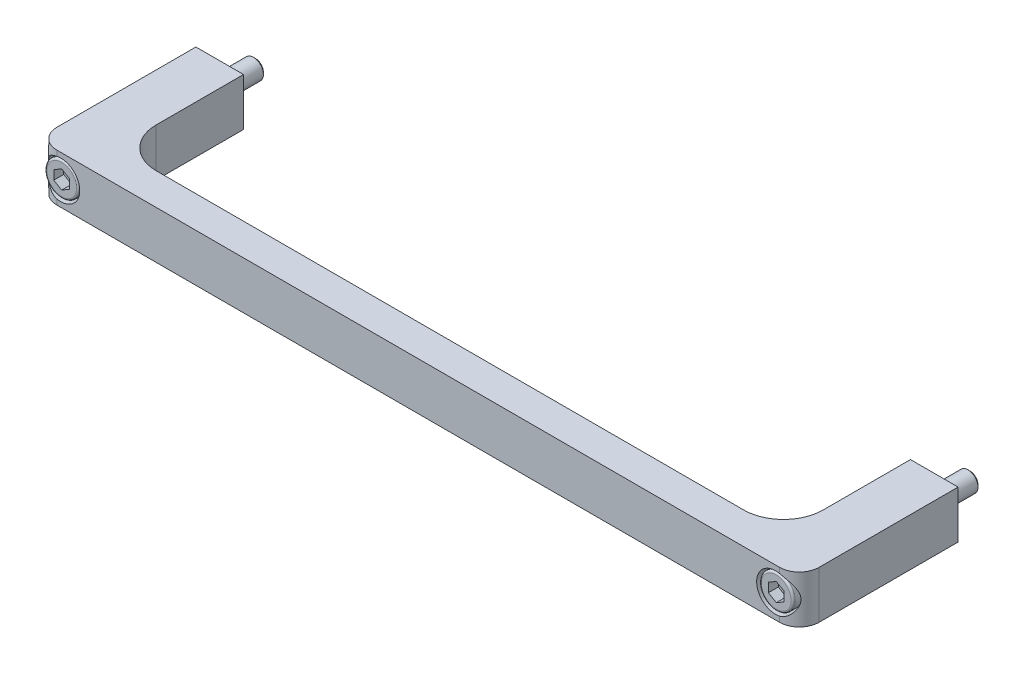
ISO-10303-21;
HEADER;
FILE_DESCRIPTION(('STEP AP214'),'2;1');
FILE_NAME('part.step','',(''),(''),'','','');
FILE_SCHEMA(('AUTOMOTIVE_DESIGN { 1 0 10303 214 1 1 1 1 }'));
ENDSEC;
DATA;
#1=APPLICATION_CONTEXT('core data for automotive mechanical design processes');
#2=APPLICATION_PROTOCOL_DEFINITION('international standard','automotive_design',2000,#1);
#3=PRODUCT_CONTEXT('',#1,'mechanical');
#4=PRODUCT('Part','Part','',(#3));
#5=PRODUCT_RELATED_PRODUCT_CATEGORY('part','',(#4));
#6=PRODUCT_DEFINITION_FORMATION('','',#4);
#7=PRODUCT_DEFINITION_CONTEXT('part definition',#1,'design');
#8=PRODUCT_DEFINITION('design','',#6,#7);
#9=PRODUCT_DEFINITION_SHAPE('','',#8);
#10=(LENGTH_UNIT() NAMED_UNIT(*) SI_UNIT(.MILLI.,.METRE.));
#11=(NAMED_UNIT(*) PLANE_ANGLE_UNIT() SI_UNIT($,.RADIAN.));
#12=(NAMED_UNIT(*) SI_UNIT($,.STERADIAN.) SOLID_ANGLE_UNIT());
#13=UNCERTAINTY_MEASURE_WITH_UNIT(LENGTH_MEASURE(1.E-05),#10,'distance_accuracy_value','');
#14=(GEOMETRIC_REPRESENTATION_CONTEXT(3) GLOBAL_UNCERTAINTY_ASSIGNED_CONTEXT((#13)) GLOBAL_UNIT_ASSIGNED_CONTEXT((#10,
#11,#12)) REPRESENTATION_CONTEXT('',''));
#15=CARTESIAN_POINT('',(0.,0.,0.));
#16=DIRECTION('',(0.,0.,1.));
#17=DIRECTION('',(1.,0.,0.));
#18=AXIS2_PLACEMENT_3D('',#15,#16,#17);
#19=CARTESIAN_POINT('',(180.,-1.38960957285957E-13,39.8));
#20=DIRECTION('',(0.,0.,-1.));
#21=DIRECTION('',(0.,1.,0.));
#22=AXIS2_PLACEMENT_3D('',#19,#20,#21);
#23=PLANE('',#22);
#24=CARTESIAN_POINT('',(180.,-1.38960957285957E-13,39.8));
#25=DIRECTION('',(0.,0.,-1.));
#26=DIRECTION('',(0.,1.,0.));
#27=AXIS2_PLACEMENT_3D('',#24,#25,#26);
#28=CIRCLE('',#27,3.75);
#29=CARTESIAN_POINT('',(180.,3.74999999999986,39.8));
#30=VERTEX_POINT('',#29);
#31=EDGE_CURVE('E268',#30,#30,#28,.T.);
#32=ORIENTED_EDGE('',*,*,#31,.F.);
#33=EDGE_LOOP('',(#32));
#34=FACE_BOUND('',#33,.T.);
#35=DIRECTION('',(0.,-1.,0.));
#36=VECTOR('',#35,1.);
#37=CARTESIAN_POINT('',(178.,-1.38960957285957E-13,39.8));
#38=LINE('',#37,#36);
#39=CARTESIAN_POINT('',(178.,1.15470053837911,39.8));
#40=VERTEX_POINT('',#39);
#41=CARTESIAN_POINT('',(178.,-1.15470053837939,39.8));
#42=VERTEX_POINT('',#41);
#43=EDGE_CURVE('E9',#40,#42,#38,.T.);
#44=ORIENTED_EDGE('',*,*,#43,.F.);
#45=DIRECTION('',(-0.866025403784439,-0.5,0.));
#46=VECTOR('',#45,1.);
#47=CARTESIAN_POINT('',(179.,1.73205080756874,39.8));
#48=LINE('',#47,#46);
#49=CARTESIAN_POINT('',(180.,2.30940107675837,39.8));
#50=VERTEX_POINT('',#49);
#51=EDGE_CURVE('E433',#50,#40,#48,.T.);
#52=ORIENTED_EDGE('',*,*,#51,.F.);
#53=DIRECTION('',(-0.866025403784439,0.5,0.));
#54=VECTOR('',#53,1.);
#55=CARTESIAN_POINT('',(181.,1.73205080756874,39.8));
#56=LINE('',#55,#54);
#57=CARTESIAN_POINT('',(182.,1.15470053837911,39.8));
#58=VERTEX_POINT('',#57);
#59=EDGE_CURVE('E435',#58,#50,#56,.T.);
#60=ORIENTED_EDGE('',*,*,#59,.F.);
#61=DIRECTION('',(0.,1.,0.));
#62=VECTOR('',#61,1.);
#63=CARTESIAN_POINT('',(182.,-1.38960957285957E-13,39.8));
#64=LINE('',#63,#62);
#65=CARTESIAN_POINT('',(182.,-1.15470053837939,39.8));
#66=VERTEX_POINT('',#65);
#67=EDGE_CURVE('E437',#66,#58,#64,.T.);
#68=ORIENTED_EDGE('',*,*,#67,.F.);
#69=DIRECTION('',(0.866025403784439,0.5,0.));
#70=VECTOR('',#69,1.);
#71=CARTESIAN_POINT('',(181.,-1.73205080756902,39.8));
#72=LINE('',#71,#70);
#73=CARTESIAN_POINT('',(180.,-2.30940107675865,39.8));
#74=VERTEX_POINT('',#73);
#75=EDGE_CURVE('E439',#74,#66,#72,.T.);
#76=ORIENTED_EDGE('',*,*,#75,.F.);
#77=DIRECTION('',(0.866025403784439,-0.5,0.));
#78=VECTOR('',#77,1.);
#79=CARTESIAN_POINT('',(179.,-1.73205080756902,39.8));
#80=LINE('',#79,#78);
#81=EDGE_CURVE('E23',#42,#74,#80,.T.);
#82=ORIENTED_EDGE('',*,*,#81,.F.);
#83=EDGE_LOOP('',(#44,#52,#60,#68,#76,#82));
#84=FACE_BOUND('',#83,.T.);
#85=ADVANCED_FACE('F14',(#34,#84),#23,.F.);
#86=CARTESIAN_POINT('',(0.,-1.38960957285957E-13,39.8));
#87=DIRECTION('',(0.,0.,-1.));
#88=DIRECTION('',(0.,1.,0.));
#89=AXIS2_PLACEMENT_3D('',#86,#87,#88);
#90=PLANE('',#89);
#91=CARTESIAN_POINT('',(0.,-1.38960957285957E-13,39.8));
#92=DIRECTION('',(0.,0.,-1.));
#93=DIRECTION('',(0.,1.,0.));
#94=AXIS2_PLACEMENT_3D('',#91,#92,#93);
#95=CIRCLE('',#94,3.75);
#96=CARTESIAN_POINT('',(0.,3.74999999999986,39.8));
#97=VERTEX_POINT('',#96);
#98=EDGE_CURVE('E277',#97,#97,#95,.T.);
#99=ORIENTED_EDGE('',*,*,#98,.F.);
#100=EDGE_LOOP('',(#99));
#101=FACE_BOUND('',#100,.T.);
#102=DIRECTION('',(0.,-1.,0.));
#103=VECTOR('',#102,1.);
#104=CARTESIAN_POINT('',(-2.,-1.38960957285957E-13,39.8));
#105=LINE('',#104,#103);
#106=CARTESIAN_POINT('',(-2.,1.15470053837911,39.8));
#107=VERTEX_POINT('',#106);
#108=CARTESIAN_POINT('',(-2.,-1.15470053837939,39.8));
#109=VERTEX_POINT('',#108);
#110=EDGE_CURVE('E431',#107,#109,#105,.T.);
#111=ORIENTED_EDGE('',*,*,#110,.F.);
#112=DIRECTION('',(-0.866025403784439,-0.5,0.));
#113=VECTOR('',#112,1.);
#114=CARTESIAN_POINT('',(-1.,1.73205080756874,39.8));
#115=LINE('',#114,#113);
#116=CARTESIAN_POINT('',(0.,2.30940107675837,39.8));
#117=VERTEX_POINT('',#116);
#118=EDGE_CURVE('E420',#117,#107,#115,.T.);
#119=ORIENTED_EDGE('',*,*,#118,.F.);
#120=DIRECTION('',(-0.866025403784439,0.5,0.));
#121=VECTOR('',#120,1.);
#122=CARTESIAN_POINT('',(1.,1.73205080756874,39.8));
#123=LINE('',#122,#121);
#124=CARTESIAN_POINT('',(2.,1.15470053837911,39.8));
#125=VERTEX_POINT('',#124);
#126=EDGE_CURVE('E422',#125,#117,#123,.T.);
#127=ORIENTED_EDGE('',*,*,#126,.F.);
#128=DIRECTION('',(0.,1.,0.));
#129=VECTOR('',#128,1.);
#130=CARTESIAN_POINT('',(2.,-1.38960957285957E-13,39.8));
#131=LINE('',#130,#129);
#132=CARTESIAN_POINT('',(2.,-1.15470053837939,39.8));
#133=VERTEX_POINT('',#132);
#134=EDGE_CURVE('E424',#133,#125,#131,.T.);
#135=ORIENTED_EDGE('',*,*,#134,.F.);
#136=DIRECTION('',(0.866025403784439,0.5,0.));
#137=VECTOR('',#136,1.);
#138=CARTESIAN_POINT('',(1.,-1.73205080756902,39.8));
#139=LINE('',#138,#137);
#140=CARTESIAN_POINT('',(0.,-2.30940107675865,39.8));
#141=VERTEX_POINT('',#140);
#142=EDGE_CURVE('E426',#141,#133,#139,.T.);
#143=ORIENTED_EDGE('',*,*,#142,.F.);
#144=DIRECTION('',(0.866025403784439,-0.5,0.));
#145=VECTOR('',#144,1.);
#146=CARTESIAN_POINT('',(-1.,-1.73205080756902,39.8));
#147=LINE('',#146,#145);
#148=EDGE_CURVE('E429',#109,#141,#147,.T.);
#149=ORIENTED_EDGE('',*,*,#148,.F.);
#150=EDGE_LOOP('',(#111,#119,#127,#135,#143,#149));
#151=FACE_BOUND('',#150,.T.);
#152=ADVANCED_FACE('F520',(#101,#151),#90,.F.);
#153=CARTESIAN_POINT('',(181.,-6.00000000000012,35.));
#154=DIRECTION('',(0.,1.,0.));
#155=DIRECTION('',(-1.,0.,0.));
#156=AXIS2_PLACEMENT_3D('',#153,#154,#155);
#157=CYLINDRICAL_SURFACE('',#156,5.);
#158=CARTESIAN_POINT('',(181.,-4.64354390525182,40.));
#159=CARTESIAN_POINT('',(181.113577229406,-4.61911352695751,40.000026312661));
#160=CARTESIAN_POINT('',(181.226198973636,-4.5904727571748,39.996131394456));
#161=CARTESIAN_POINT('',(181.448480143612,-4.5252330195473,39.9810830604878));
#162=CARTESIAN_POINT('',(181.558142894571,-4.48864344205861,39.9699381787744));
#163=CARTESIAN_POINT('',(181.772778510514,-4.40826406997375,39.9410985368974));
#164=CARTESIAN_POINT('',(181.877784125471,-4.36454038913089,39.9234622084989));
#165=CARTESIAN_POINT('',(182.083450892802,-4.27019279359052,39.8823298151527));
#166=CARTESIAN_POINT('',(182.184110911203,-4.21956709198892,39.8588322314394));
#167=CARTESIAN_POINT('',(182.477816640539,-4.05863601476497,39.7808868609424));
#168=CARTESIAN_POINT('',(182.663755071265,-3.93883272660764,39.7188155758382));
#169=CARTESIAN_POINT('',(183.014161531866,-3.67767986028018,39.5802666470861));
#170=CARTESIAN_POINT('',(183.178576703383,-3.53627901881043,39.5037546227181));
#171=CARTESIAN_POINT('',(183.505563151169,-3.2145083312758,39.3313669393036));
#172=CARTESIAN_POINT('',(183.664844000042,-3.03145406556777,39.2342729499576));
#173=CARTESIAN_POINT('',(183.953554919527,-2.64393120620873,39.0381869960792));
#174=CARTESIAN_POINT('',(184.082967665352,-2.43945028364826,38.9391939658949));
#175=CARTESIAN_POINT('',(184.300406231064,-2.02927596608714,38.7583847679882));
#176=CARTESIAN_POINT('',(184.391102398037,-1.82533494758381,38.6758243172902));
#177=CARTESIAN_POINT('',(184.544220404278,-1.40111936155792,38.528431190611));
#178=CARTESIAN_POINT('',(184.606705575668,-1.18088268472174,38.4635589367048));
#179=CARTESIAN_POINT('',(184.68939020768,-0.777505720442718,38.3750946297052));
#180=CARTESIAN_POINT('',(184.715905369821,-0.597016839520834,38.3455288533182));
#181=CARTESIAN_POINT('',(184.74785251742,-0.232010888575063,38.3097185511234));
#182=CARTESIAN_POINT('',(184.753317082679,-0.0475004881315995,38.3034379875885));
#183=CARTESIAN_POINT('',(184.742772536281,0.32004763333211,38.3153716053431));
#184=CARTESIAN_POINT('',(184.726764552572,0.503085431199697,38.3335844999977));
#185=CARTESIAN_POINT('',(184.674507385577,0.862962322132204,38.3910845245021));
#186=CARTESIAN_POINT('',(184.638217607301,1.03978822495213,38.4304139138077));
#187=CARTESIAN_POINT('',(184.528000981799,1.45744491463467,38.544254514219));
#188=CARTESIAN_POINT('',(184.444640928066,1.69363572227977,38.626612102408));
#189=CARTESIAN_POINT('',(184.295087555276,2.03224760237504,38.7612447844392));
#190=CARTESIAN_POINT('',(184.24105214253,2.14265838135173,38.8080496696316));
#191=CARTESIAN_POINT('',(184.12505065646,2.35826640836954,38.9038071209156));
#192=CARTESIAN_POINT('',(184.063085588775,2.46346431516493,38.9527594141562));
#193=CARTESIAN_POINT('',(183.860708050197,2.77873907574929,39.1043117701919));
#194=CARTESIAN_POINT('',(183.707477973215,2.98020199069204,39.2081022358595));
#195=CARTESIAN_POINT('',(183.368846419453,3.35822314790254,39.4076351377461));
#196=CARTESIAN_POINT('',(183.183479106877,3.53480748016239,39.5033859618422));
#197=CARTESIAN_POINT('',(182.809666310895,3.83632408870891,39.6648073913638));
#198=CARTESIAN_POINT('',(182.625331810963,3.96502834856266,39.732815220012));
#199=CARTESIAN_POINT('',(182.333406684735,4.13890556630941,39.8199942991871));
#200=CARTESIAN_POINT('',(182.233611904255,4.19363274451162,39.8465668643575));
#201=CARTESIAN_POINT('',(182.029283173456,4.29622741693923,39.8940340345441));
#202=CARTESIAN_POINT('',(181.924750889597,4.34409729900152,39.9149306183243));
#203=CARTESIAN_POINT('',(181.687151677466,4.44253129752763,39.9543331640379));
#204=CARTESIAN_POINT('',(181.553015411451,4.49121867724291,39.9712061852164));
#205=CARTESIAN_POINT('',(181.348187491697,4.55522115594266,39.9883353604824));
#206=CARTESIAN_POINT('',(181.279206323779,4.57507245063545,39.9926820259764));
#207=CARTESIAN_POINT('',(181.140272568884,4.6116637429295,39.9985159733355));
#208=CARTESIAN_POINT('',(181.070319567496,4.6284023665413,40.0000019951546));
#209=CARTESIAN_POINT('',(181.,4.64354390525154,40.));
#210=B_SPLINE_CURVE_WITH_KNOTS('',3,(#158,#159,#160,#161,#162,#163,#164,#165,#166,#167,#168,
#169,#170,#171,#172,#173,#174,#175,#176,#177,#178,#179,#180,#181,#182,#183,#184,#185,#186,#187,
#188,#189,#190,#191,#192,#193,#194,#195,#196,#197,#198,#199,#200,#201,#202,#203,#204,#205,#206,
#207,#208,#209),.UNSPECIFIED.,.F.,.F.,(4,2,2,2,2,2,2,2,2,2,2,2,2,2,2,2,2,2,2,2,2,2,2,2,2,4),(0.,
0.348307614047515,0.696205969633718,1.04104644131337,1.38597636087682,2.07210353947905,
2.75988535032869,3.54118531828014,4.32293734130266,5.03460033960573,5.74465765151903,
6.29670085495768,6.84788932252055,7.3990488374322,7.95131549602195,8.73767249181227,
9.13202620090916,9.52632994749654,10.3438248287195,11.1604559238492,11.8620649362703,
12.2123213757,12.5624555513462,12.9924670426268,13.208090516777,13.4238089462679),.UNSPECIFIED.);
#211=CARTESIAN_POINT('',(181.,-4.64354390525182,40.));
#212=VERTEX_POINT('',#211);
#213=CARTESIAN_POINT('',(181.,4.64354390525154,40.));
#214=VERTEX_POINT('',#213);
#215=EDGE_CURVE('E283',#212,#214,#210,.T.);
#216=ORIENTED_EDGE('',*,*,#215,.F.);
#217=DIRECTION('',(0.,1.,0.));
#218=VECTOR('',#217,1.);
#219=CARTESIAN_POINT('',(181.,-6.00000000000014,40.));
#220=LINE('',#219,#218);
#221=CARTESIAN_POINT('',(181.,-6.00000000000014,40.));
#222=VERTEX_POINT('',#221);
#223=EDGE_CURVE('E387',#222,#212,#220,.T.);
#224=ORIENTED_EDGE('',*,*,#223,.F.);
#225=CARTESIAN_POINT('',(181.,-6.00000000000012,35.));
#226=DIRECTION('',(0.,-1.,0.));
#227=DIRECTION('',(1.,0.,0.));
#228=AXIS2_PLACEMENT_3D('',#225,#226,#227);
#229=CIRCLE('',#228,5.);
#230=CARTESIAN_POINT('',(186.,-6.00000000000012,35.));
#231=VERTEX_POINT('',#230);
#232=EDGE_CURVE('E349',#231,#222,#229,.T.);
#233=ORIENTED_EDGE('',*,*,#232,.F.);
#234=DIRECTION('',(0.,1.,0.));
#235=VECTOR('',#234,1.);
#236=CARTESIAN_POINT('',(186.,-6.00000000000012,35.));
#237=LINE('',#236,#235);
#238=CARTESIAN_POINT('',(186.,5.99999999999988,35.));
#239=VERTEX_POINT('',#238);
#240=EDGE_CURVE('E390',#231,#239,#237,.T.);
#241=ORIENTED_EDGE('',*,*,#240,.T.);
#242=CARTESIAN_POINT('',(181.,5.99999999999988,35.));
#243=DIRECTION('',(0.,-1.,0.));
#244=DIRECTION('',(1.,0.,0.));
#245=AXIS2_PLACEMENT_3D('',#242,#243,#244);
#246=CIRCLE('',#245,5.);
#247=CARTESIAN_POINT('',(181.,5.99999999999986,40.));
#248=VERTEX_POINT('',#247);
#249=EDGE_CURVE('E378',#239,#248,#246,.T.);
#250=ORIENTED_EDGE('',*,*,#249,.T.);
#251=EDGE_CURVE('E386',#214,#248,#220,.T.);
#252=ORIENTED_EDGE('',*,*,#251,.F.);
#253=EDGE_LOOP('',(#216,#224,#233,#241,#250,#252));
#254=FACE_BOUND('',#253,.T.);
#255=ADVANCED_FACE('F293',(#254),#157,.T.);
#256=CARTESIAN_POINT('',(-1.,-6.00000000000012,35.));
#257=DIRECTION('',(0.,1.,0.));
#258=DIRECTION('',(-1.,0.,0.));
#259=AXIS2_PLACEMENT_3D('',#256,#257,#258);
#260=CYLINDRICAL_SURFACE('',#259,5.);
#261=CARTESIAN_POINT('',(-1.,4.64354390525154,40.));
#262=CARTESIAN_POINT('',(-1.11357722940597,4.61911352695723,40.000026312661));
#263=CARTESIAN_POINT('',(-1.22619897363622,4.59047275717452,39.9961313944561));
#264=CARTESIAN_POINT('',(-1.44848014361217,4.52523301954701,39.9810830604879));
#265=CARTESIAN_POINT('',(-1.55814289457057,4.48864344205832,39.9699381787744));
#266=CARTESIAN_POINT('',(-1.77277851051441,4.40826406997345,39.9410985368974));
#267=CARTESIAN_POINT('',(-1.87778412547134,4.36454038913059,39.9234622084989));
#268=CARTESIAN_POINT('',(-2.08345089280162,4.27019279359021,39.8823298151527));
#269=CARTESIAN_POINT('',(-2.18411091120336,4.21956709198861,39.8588322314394));
#270=CARTESIAN_POINT('',(-2.47781664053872,4.05863601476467,39.7808868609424));
#271=CARTESIAN_POINT('',(-2.66375507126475,3.93883272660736,39.7188155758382));
#272=CARTESIAN_POINT('',(-3.01416153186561,3.67767986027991,39.5802666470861));
#273=CARTESIAN_POINT('',(-3.17857670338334,3.53627901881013,39.5037546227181));
#274=CARTESIAN_POINT('',(-3.50556315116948,3.21450833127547,39.3313669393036));
#275=CARTESIAN_POINT('',(-3.66484400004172,3.03145406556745,39.2342729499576));
#276=CARTESIAN_POINT('',(-3.9535549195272,2.64393120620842,39.0381869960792));
#277=CARTESIAN_POINT('',(-4.08296766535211,2.43945028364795,38.9391939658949));
#278=CARTESIAN_POINT('',(-4.30040623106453,2.02927596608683,38.7583847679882));
#279=CARTESIAN_POINT('',(-4.39110239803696,1.82533494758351,38.6758243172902));
#280=CARTESIAN_POINT('',(-4.54422040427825,1.40111936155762,38.528431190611));
#281=CARTESIAN_POINT('',(-4.60670557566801,1.18088268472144,38.4635589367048));
#282=CARTESIAN_POINT('',(-4.68939020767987,0.777505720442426,38.3750946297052));
#283=CARTESIAN_POINT('',(-4.71590536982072,0.597016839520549,38.3455288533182));
#284=CARTESIAN_POINT('',(-4.74785251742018,0.23201088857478,38.3097185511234));
#285=CARTESIAN_POINT('',(-4.75331708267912,0.0475004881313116,38.3034379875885));
#286=CARTESIAN_POINT('',(-4.74277253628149,-0.320047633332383,38.3153716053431));
#287=CARTESIAN_POINT('',(-4.72676455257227,-0.503085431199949,38.3335844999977));
#288=CARTESIAN_POINT('',(-4.67450738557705,-0.862962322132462,38.3910845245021));
#289=CARTESIAN_POINT('',(-4.63821760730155,-1.03978822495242,38.4304139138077));
#290=CARTESIAN_POINT('',(-4.52800098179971,-1.45744491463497,38.5442545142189));
#291=CARTESIAN_POINT('',(-4.44464092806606,-1.69363572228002,38.626612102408));
#292=CARTESIAN_POINT('',(-4.29508755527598,-2.03224760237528,38.7612447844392));
#293=CARTESIAN_POINT('',(-4.24105214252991,-2.14265838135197,38.8080496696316));
#294=CARTESIAN_POINT('',(-4.1250506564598,-2.3582664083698,38.9038071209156));
#295=CARTESIAN_POINT('',(-4.06308558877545,-2.46346431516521,38.9527594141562));
#296=CARTESIAN_POINT('',(-3.86070805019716,-2.77873907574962,39.1043117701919));
#297=CARTESIAN_POINT('',(-3.7074779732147,-2.9802019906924,39.2081022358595));
#298=CARTESIAN_POINT('',(-3.36884641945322,-3.35822314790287,39.4076351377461));
#299=CARTESIAN_POINT('',(-3.18347910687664,-3.53480748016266,39.5033859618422));
#300=CARTESIAN_POINT('',(-2.80966631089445,-3.83632408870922,39.6648073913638));
#301=CARTESIAN_POINT('',(-2.62533181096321,-3.96502834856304,39.7328152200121));
#302=CARTESIAN_POINT('',(-2.33340668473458,-4.13890556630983,39.8199942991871));
#303=CARTESIAN_POINT('',(-2.23361190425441,-4.19363274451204,39.8465668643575));
#304=CARTESIAN_POINT('',(-2.02928317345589,-4.29622741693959,39.8940340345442));
#305=CARTESIAN_POINT('',(-1.92475088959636,-4.34409729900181,39.9149306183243));
#306=CARTESIAN_POINT('',(-1.68715167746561,-4.44253129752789,39.9543331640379));
#307=CARTESIAN_POINT('',(-1.55301541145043,-4.49121867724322,39.9712061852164));
#308=CARTESIAN_POINT('',(-1.34818749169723,-4.55522115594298,39.9883353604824));
#309=CARTESIAN_POINT('',(-1.27920632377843,-4.57507245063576,39.9926820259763));
#310=CARTESIAN_POINT('',(-1.14027256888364,-4.61166374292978,39.9985159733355));
#311=CARTESIAN_POINT('',(-1.07031956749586,-4.62840236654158,40.0000019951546));
#312=CARTESIAN_POINT('',(-1.,-4.64354390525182,40.));
#313=B_SPLINE_CURVE_WITH_KNOTS('',3,(#261,#262,#263,#264,#265,#266,#267,#268,#269,#270,#271,
#272,#273,#274,#275,#276,#277,#278,#279,#280,#281,#282,#283,#284,#285,#286,#287,#288,#289,#290,
#291,#292,#293,#294,#295,#296,#297,#298,#299,#300,#301,#302,#303,#304,#305,#306,#307,#308,#309,
#310,#311,#312),.UNSPECIFIED.,.F.,.F.,(4,2,2,2,2,2,2,2,2,2,2,2,2,2,2,2,2,2,2,2,2,2,2,2,2,4),(0.,
0.348307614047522,0.696205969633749,1.04104644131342,1.38597636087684,2.07210353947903,
2.75988535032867,3.5411853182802,4.32293734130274,5.03460033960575,5.74465765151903,
6.29670085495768,6.84788932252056,7.39904883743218,7.95131549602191,8.73767249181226,
9.13202620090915,9.52632994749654,10.3438248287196,11.1604559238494,11.8620649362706,
12.2123213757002,12.5624555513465,12.992467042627,13.2080905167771,13.4238089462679),.UNSPECIFIED.);
#314=CARTESIAN_POINT('',(-1.,4.64354390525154,40.));
#315=VERTEX_POINT('',#314);
#316=CARTESIAN_POINT('',(-1.,-4.64354390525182,40.));
#317=VERTEX_POINT('',#316);
#318=EDGE_CURVE('E317',#315,#317,#313,.T.);
#319=ORIENTED_EDGE('',*,*,#318,.F.);
#320=DIRECTION('',(0.,1.,0.));
#321=VECTOR('',#320,1.);
#322=CARTESIAN_POINT('',(-1.,-6.00000000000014,40.));
#323=LINE('',#322,#321);
#324=CARTESIAN_POINT('',(-1.,5.99999999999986,40.));
#325=VERTEX_POINT('',#324);
#326=EDGE_CURVE('E353',#315,#325,#323,.T.);
#327=ORIENTED_EDGE('',*,*,#326,.T.);
#328=CARTESIAN_POINT('',(-1.,5.99999999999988,35.));
#329=DIRECTION('',(0.,-1.,0.));
#330=DIRECTION('',(1.,0.,0.));
#331=AXIS2_PLACEMENT_3D('',#328,#329,#330);
#332=CIRCLE('',#331,5.);
#333=CARTESIAN_POINT('',(-6.,5.99999999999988,35.));
#334=VERTEX_POINT('',#333);
#335=EDGE_CURVE('E324',#325,#334,#332,.T.);
#336=ORIENTED_EDGE('',*,*,#335,.T.);
#337=DIRECTION('',(0.,1.,0.));
#338=VECTOR('',#337,1.);
#339=CARTESIAN_POINT('',(-6.,-6.00000000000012,35.));
#340=LINE('',#339,#338);
#341=CARTESIAN_POINT('',(-6.,-6.00000000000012,35.));
#342=VERTEX_POINT('',#341);
#343=EDGE_CURVE('E413',#342,#334,#340,.T.);
#344=ORIENTED_EDGE('',*,*,#343,.F.);
#345=CARTESIAN_POINT('',(-1.,-6.00000000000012,35.));
#346=DIRECTION('',(0.,-1.,0.));
#347=DIRECTION('',(1.,0.,0.));
#348=AXIS2_PLACEMENT_3D('',#345,#346,#347);
#349=CIRCLE('',#348,5.);
#350=CARTESIAN_POINT('',(-1.,-6.00000000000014,40.));
#351=VERTEX_POINT('',#350);
#352=EDGE_CURVE('E325',#351,#342,#349,.T.);
#353=ORIENTED_EDGE('',*,*,#352,.F.);
#354=EDGE_CURVE('E383',#351,#317,#323,.T.);
#355=ORIENTED_EDGE('',*,*,#354,.T.);
#356=EDGE_LOOP('',(#319,#327,#336,#344,#353,#355));
#357=FACE_BOUND('',#356,.T.);
#358=ADVANCED_FACE('F16',(#357),#260,.T.);
#359=CARTESIAN_POINT('',(-6.,-6.00000000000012,35.));
#360=DIRECTION('',(1.,0.,0.));
#361=DIRECTION('',(0.,1.,0.));
#362=AXIS2_PLACEMENT_3D('',#359,#360,#361);
#363=PLANE('',#362);
#364=DIRECTION('',(0.,0.,-1.));
#365=VECTOR('',#364,1.);
#366=CARTESIAN_POINT('',(-6.,5.99999999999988,35.));
#367=LINE('',#366,#365);
#368=CARTESIAN_POINT('',(-6.,6.,0.));
#369=VERTEX_POINT('',#368);
#370=EDGE_CURVE('E356',#334,#369,#367,.T.);
#371=ORIENTED_EDGE('',*,*,#370,.T.);
#372=DIRECTION('',(0.,1.,0.));
#373=VECTOR('',#372,1.);
#374=CARTESIAN_POINT('',(-6.,-6.,0.));
#375=LINE('',#374,#373);
#376=CARTESIAN_POINT('',(-6.,-6.,0.));
#377=VERTEX_POINT('',#376);
#378=EDGE_CURVE('E410',#377,#369,#375,.T.);
#379=ORIENTED_EDGE('',*,*,#378,.F.);
#380=DIRECTION('',(0.,0.,-1.));
#381=VECTOR('',#380,1.);
#382=CARTESIAN_POINT('',(-6.,-6.00000000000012,35.));
#383=LINE('',#382,#381);
#384=EDGE_CURVE('E328',#342,#377,#383,.T.);
#385=ORIENTED_EDGE('',*,*,#384,.F.);
#386=ORIENTED_EDGE('',*,*,#343,.T.);
#387=EDGE_LOOP('',(#371,#379,#385,#386));
#388=FACE_BOUND('',#387,.T.);
#389=ADVANCED_FACE('F565',(#388),#363,.F.);
#390=CARTESIAN_POINT('',(-6.,-6.,0.));
#391=DIRECTION('',(0.,0.,1.));
#392=DIRECTION('',(0.,-1.,0.));
#393=AXIS2_PLACEMENT_3D('',#390,#391,#392);
#394=PLANE('',#393);
#395=DIRECTION('',(1.,0.,0.));
#396=VECTOR('',#395,1.);
#397=CARTESIAN_POINT('',(-6.,6.,0.));
#398=LINE('',#397,#396);
#399=CARTESIAN_POINT('',(6.,6.,0.));
#400=VERTEX_POINT('',#399);
#401=EDGE_CURVE('E358',#369,#400,#398,.T.);
#402=ORIENTED_EDGE('',*,*,#401,.T.);
#403=DIRECTION('',(0.,1.,0.));
#404=VECTOR('',#403,1.);
#405=CARTESIAN_POINT('',(6.,-6.,0.));
#406=LINE('',#405,#404);
#407=CARTESIAN_POINT('',(6.,-6.,0.));
#408=VERTEX_POINT('',#407);
#409=EDGE_CURVE('E407',#408,#400,#406,.T.);
#410=ORIENTED_EDGE('',*,*,#409,.F.);
#411=DIRECTION('',(1.,0.,0.));
#412=VECTOR('',#411,1.);
#413=CARTESIAN_POINT('',(-6.,-6.,0.));
#414=LINE('',#413,#412);
#415=EDGE_CURVE('E331',#377,#408,#414,.T.);
#416=ORIENTED_EDGE('',*,*,#415,.F.);
#417=ORIENTED_EDGE('',*,*,#378,.T.);
#418=EDGE_LOOP('',(#402,#410,#416,#417));
#419=FACE_BOUND('',#418,.T.);
#420=CARTESIAN_POINT('',(0.,0.,0.));
#421=DIRECTION('',(0.,0.,-1.));
#422=DIRECTION('',(0.,1.,0.));
#423=AXIS2_PLACEMENT_3D('',#420,#421,#422);
#424=CIRCLE('',#423,2.5);
#425=CARTESIAN_POINT('',(0.,2.5,0.));
#426=VERTEX_POINT('',#425);
#427=EDGE_CURVE('E912',#426,#426,#424,.T.);
#428=ORIENTED_EDGE('',*,*,#427,.F.);
#429=EDGE_LOOP('',(#428));
#430=FACE_BOUND('',#429,.T.);
#431=ADVANCED_FACE('F600',(#419,#430),#394,.F.);
#432=CARTESIAN_POINT('',(6.,-6.,0.));
#433=DIRECTION('',(-1.,0.,0.));
#434=DIRECTION('',(0.,-1.,0.));
#435=AXIS2_PLACEMENT_3D('',#432,#433,#434);
#436=PLANE('',#435);
#437=DIRECTION('',(0.,0.,1.));
#438=VECTOR('',#437,1.);
#439=CARTESIAN_POINT('',(6.,6.,0.));
#440=LINE('',#439,#438);
#441=CARTESIAN_POINT('',(6.,5.99999999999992,22.));
#442=VERTEX_POINT('',#441);
#443=EDGE_CURVE('E360',#400,#442,#440,.T.);
#444=ORIENTED_EDGE('',*,*,#443,.T.);
#445=DIRECTION('',(0.,1.,0.));
#446=VECTOR('',#445,1.);
#447=CARTESIAN_POINT('',(6.,-6.00000000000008,22.));
#448=LINE('',#447,#446);
#449=CARTESIAN_POINT('',(6.,-6.00000000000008,22.));
#450=VERTEX_POINT('',#449);
#451=EDGE_CURVE('E405',#450,#442,#448,.T.);
#452=ORIENTED_EDGE('',*,*,#451,.F.);
#453=DIRECTION('',(0.,0.,1.));
#454=VECTOR('',#453,1.);
#455=CARTESIAN_POINT('',(6.,-6.,0.));
#456=LINE('',#455,#454);
#457=EDGE_CURVE('E333',#408,#450,#456,.T.);
#458=ORIENTED_EDGE('',*,*,#457,.F.);
#459=ORIENTED_EDGE('',*,*,#409,.T.);
#460=EDGE_LOOP('',(#444,#452,#458,#459));
#461=FACE_BOUND('',#460,.T.);
#462=ADVANCED_FACE('F605',(#461),#436,.F.);
#463=CARTESIAN_POINT('',(16.,-6.00000000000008,22.));
#464=DIRECTION('',(0.,1.,0.));
#465=DIRECTION('',(-1.,0.,0.));
#466=AXIS2_PLACEMENT_3D('',#463,#464,#465);
#467=CYLINDRICAL_SURFACE('',#466,10.);
#468=CARTESIAN_POINT('',(16.,5.99999999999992,22.));
#469=DIRECTION('',(0.,-1.,0.));
#470=DIRECTION('',(1.,0.,0.));
#471=AXIS2_PLACEMENT_3D('',#468,#469,#470);
#472=CIRCLE('',#471,10.);
#473=CARTESIAN_POINT('',(16.,5.99999999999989,32.));
#474=VERTEX_POINT('',#473);
#475=EDGE_CURVE('E363',#474,#442,#472,.T.);
#476=ORIENTED_EDGE('',*,*,#475,.F.);
#477=DIRECTION('',(0.,1.,0.));
#478=VECTOR('',#477,1.);
#479=CARTESIAN_POINT('',(16.,-6.00000000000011,32.));
#480=LINE('',#479,#478);
#481=CARTESIAN_POINT('',(16.,-6.00000000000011,32.));
#482=VERTEX_POINT('',#481);
#483=EDGE_CURVE('E403',#482,#474,#480,.T.);
#484=ORIENTED_EDGE('',*,*,#483,.F.);
#485=CARTESIAN_POINT('',(16.,-6.00000000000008,22.));
#486=DIRECTION('',(0.,-1.,0.));
#487=DIRECTION('',(1.,0.,0.));
#488=AXIS2_PLACEMENT_3D('',#485,#486,#487);
#489=CIRCLE('',#488,10.);
#490=EDGE_CURVE('E335',#482,#450,#489,.T.);
#491=ORIENTED_EDGE('',*,*,#490,.T.);
#492=ORIENTED_EDGE('',*,*,#451,.T.);
#493=EDGE_LOOP('',(#476,#484,#491,#492));
#494=FACE_BOUND('',#493,.T.);
#495=ADVANCED_FACE('F608',(#494),#467,.F.);
#496=CARTESIAN_POINT('',(16.,-6.00000000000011,32.));
#497=DIRECTION('',(0.,0.,1.));
#498=DIRECTION('',(0.,-1.,0.));
#499=AXIS2_PLACEMENT_3D('',#496,#497,#498);
#500=PLANE('',#499);
#501=DIRECTION('',(1.,0.,0.));
#502=VECTOR('',#501,1.);
#503=CARTESIAN_POINT('',(16.,5.99999999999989,32.));
#504=LINE('',#503,#502);
#505=CARTESIAN_POINT('',(164.,5.99999999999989,32.));
#506=VERTEX_POINT('',#505);
#507=EDGE_CURVE('E366',#474,#506,#504,.T.);
#508=ORIENTED_EDGE('',*,*,#507,.T.);
#509=DIRECTION('',(0.,1.,0.));
#510=VECTOR('',#509,1.);
#511=CARTESIAN_POINT('',(164.,-6.00000000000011,32.));
#512=LINE('',#511,#510);
#513=CARTESIAN_POINT('',(164.,-6.00000000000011,32.));
#514=VERTEX_POINT('',#513);
#515=EDGE_CURVE('E401',#514,#506,#512,.T.);
#516=ORIENTED_EDGE('',*,*,#515,.F.);
#517=DIRECTION('',(1.,0.,0.));
#518=VECTOR('',#517,1.);
#519=CARTESIAN_POINT('',(16.,-6.00000000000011,32.));
#520=LINE('',#519,#518);
#521=EDGE_CURVE('E338',#482,#514,#520,.T.);
#522=ORIENTED_EDGE('',*,*,#521,.F.);
#523=ORIENTED_EDGE('',*,*,#483,.T.);
#524=EDGE_LOOP('',(#508,#516,#522,#523));
#525=FACE_BOUND('',#524,.T.);
#526=ADVANCED_FACE('F613',(#525),#500,.F.);
#527=CARTESIAN_POINT('',(164.,-6.00000000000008,22.));
#528=DIRECTION('',(0.,1.,0.));
#529=DIRECTION('',(-1.,0.,0.));
#530=AXIS2_PLACEMENT_3D('',#527,#528,#529);
#531=CYLINDRICAL_SURFACE('',#530,10.);
#532=CARTESIAN_POINT('',(164.,5.99999999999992,22.));
#533=DIRECTION('',(0.,-1.,0.));
#534=DIRECTION('',(1.,0.,0.));
#535=AXIS2_PLACEMENT_3D('',#532,#533,#534);
#536=CIRCLE('',#535,10.);
#537=CARTESIAN_POINT('',(174.,5.99999999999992,22.));
#538=VERTEX_POINT('',#537);
#539=EDGE_CURVE('E369',#538,#506,#536,.T.);
#540=ORIENTED_EDGE('',*,*,#539,.F.);
#541=DIRECTION('',(0.,1.,0.));
#542=VECTOR('',#541,1.);
#543=CARTESIAN_POINT('',(174.,-6.00000000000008,22.));
#544=LINE('',#543,#542);
#545=CARTESIAN_POINT('',(174.,-6.00000000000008,22.));
#546=VERTEX_POINT('',#545);
#547=EDGE_CURVE('E399',#546,#538,#544,.T.);
#548=ORIENTED_EDGE('',*,*,#547,.F.);
#549=CARTESIAN_POINT('',(164.,-6.00000000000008,22.));
#550=DIRECTION('',(0.,-1.,0.));
#551=DIRECTION('',(1.,0.,0.));
#552=AXIS2_PLACEMENT_3D('',#549,#550,#551);
#553=CIRCLE('',#552,10.);
#554=EDGE_CURVE('E340',#546,#514,#553,.T.);
#555=ORIENTED_EDGE('',*,*,#554,.T.);
#556=ORIENTED_EDGE('',*,*,#515,.T.);
#557=EDGE_LOOP('',(#540,#548,#555,#556));
#558=FACE_BOUND('',#557,.T.);
#559=ADVANCED_FACE('F617',(#558),#531,.F.);
#560=CARTESIAN_POINT('',(174.,-6.00000000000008,22.));
#561=DIRECTION('',(1.,0.,0.));
#562=DIRECTION('',(0.,1.,0.));
#563=AXIS2_PLACEMENT_3D('',#560,#561,#562);
#564=PLANE('',#563);
#565=DIRECTION('',(0.,0.,-1.));
#566=VECTOR('',#565,1.);
#567=CARTESIAN_POINT('',(174.,5.99999999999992,22.));
#568=LINE('',#567,#566);
#569=CARTESIAN_POINT('',(174.,6.,0.));
#570=VERTEX_POINT('',#569);
#571=EDGE_CURVE('E372',#538,#570,#568,.T.);
#572=ORIENTED_EDGE('',*,*,#571,.T.);
#573=DIRECTION('',(0.,1.,0.));
#574=VECTOR('',#573,1.);
#575=CARTESIAN_POINT('',(174.,-6.,0.));
#576=LINE('',#575,#574);
#577=CARTESIAN_POINT('',(174.,-6.,0.));
#578=VERTEX_POINT('',#577);
#579=EDGE_CURVE('E396',#578,#570,#576,.T.);
#580=ORIENTED_EDGE('',*,*,#579,.F.);
#581=DIRECTION('',(0.,0.,-1.));
#582=VECTOR('',#581,1.);
#583=CARTESIAN_POINT('',(174.,-6.00000000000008,22.));
#584=LINE('',#583,#582);
#585=EDGE_CURVE('E343',#546,#578,#584,.T.);
#586=ORIENTED_EDGE('',*,*,#585,.F.);
#587=ORIENTED_EDGE('',*,*,#547,.T.);
#588=EDGE_LOOP('',(#572,#580,#586,#587));
#589=FACE_BOUND('',#588,.T.);
#590=ADVANCED_FACE('F622',(#589),#564,.F.);
#591=CARTESIAN_POINT('',(174.,-6.,0.));
#592=DIRECTION('',(0.,0.,1.));
#593=DIRECTION('',(0.,-1.,0.));
#594=AXIS2_PLACEMENT_3D('',#591,#592,#593);
#595=PLANE('',#594);
#596=DIRECTION('',(1.,0.,0.));
#597=VECTOR('',#596,1.);
#598=CARTESIAN_POINT('',(174.,6.,0.));
#599=LINE('',#598,#597);
#600=CARTESIAN_POINT('',(186.,6.,0.));
#601=VERTEX_POINT('',#600);
#602=EDGE_CURVE('E374',#570,#601,#599,.T.);
#603=ORIENTED_EDGE('',*,*,#602,.T.);
#604=DIRECTION('',(0.,1.,0.));
#605=VECTOR('',#604,1.);
#606=CARTESIAN_POINT('',(186.,-6.,0.));
#607=LINE('',#606,#605);
#608=CARTESIAN_POINT('',(186.,-6.,0.));
#609=VERTEX_POINT('',#608);
#610=EDGE_CURVE('E393',#609,#601,#607,.T.);
#611=ORIENTED_EDGE('',*,*,#610,.F.);
#612=DIRECTION('',(1.,0.,0.));
#613=VECTOR('',#612,1.);
#614=CARTESIAN_POINT('',(174.,-6.,0.));
#615=LINE('',#614,#613);
#616=EDGE_CURVE('E345',#578,#609,#615,.T.);
#617=ORIENTED_EDGE('',*,*,#616,.F.);
#618=ORIENTED_EDGE('',*,*,#579,.T.);
#619=EDGE_LOOP('',(#603,#611,#617,#618));
#620=FACE_BOUND('',#619,.T.);
#621=CARTESIAN_POINT('',(180.,0.,0.));
#622=DIRECTION('',(0.,0.,-1.));
#623=DIRECTION('',(0.,1.,0.));
#624=AXIS2_PLACEMENT_3D('',#621,#622,#623);
#625=CIRCLE('',#624,2.5);
#626=CARTESIAN_POINT('',(180.,2.5,0.));
#627=VERTEX_POINT('',#626);
#628=EDGE_CURVE('E916',#627,#627,#625,.T.);
#629=ORIENTED_EDGE('',*,*,#628,.F.);
#630=EDGE_LOOP('',(#629));
#631=FACE_BOUND('',#630,.T.);
#632=ADVANCED_FACE('F626',(#620,#631),#595,.F.);
#633=CARTESIAN_POINT('',(186.,-6.,0.));
#634=DIRECTION('',(-1.,0.,0.));
#635=DIRECTION('',(0.,-1.,0.));
#636=AXIS2_PLACEMENT_3D('',#633,#634,#635);
#637=PLANE('',#636);
#638=DIRECTION('',(0.,0.,1.));
#639=VECTOR('',#638,1.);
#640=CARTESIAN_POINT('',(186.,6.,0.));
#641=LINE('',#640,#639);
#642=EDGE_CURVE('E376',#601,#239,#641,.T.);
#643=ORIENTED_EDGE('',*,*,#642,.T.);
#644=ORIENTED_EDGE('',*,*,#240,.F.);
#645=DIRECTION('',(0.,0.,1.));
#646=VECTOR('',#645,1.);
#647=CARTESIAN_POINT('',(186.,-6.,0.));
#648=LINE('',#647,#646);
#649=EDGE_CURVE('E347',#609,#231,#648,.T.);
#650=ORIENTED_EDGE('',*,*,#649,.F.);
#651=ORIENTED_EDGE('',*,*,#610,.T.);
#652=EDGE_LOOP('',(#643,#644,#650,#651));
#653=FACE_BOUND('',#652,.T.);
#654=ADVANCED_FACE('F628',(#653),#637,.F.);
#655=CARTESIAN_POINT('',(181.,-6.00000000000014,40.));
#656=DIRECTION('',(0.,0.,-1.));
#657=DIRECTION('',(0.,1.,0.));
#658=AXIS2_PLACEMENT_3D('',#655,#656,#657);
#659=PLANE('',#658);
#660=CARTESIAN_POINT('',(180.,-1.39659253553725E-13,40.));
#661=DIRECTION('',(0.,0.,-1.));
#662=DIRECTION('',(0.,1.,0.));
#663=AXIS2_PLACEMENT_3D('',#660,#661,#662);
#664=CIRCLE('',#663,4.75);
#665=EDGE_CURVE('E418',#214,#212,#664,.F.);
#666=ORIENTED_EDGE('',*,*,#665,.F.);
#667=ORIENTED_EDGE('',*,*,#251,.T.);
#668=DIRECTION('',(-1.,0.,0.));
#669=VECTOR('',#668,1.);
#670=CARTESIAN_POINT('',(181.,5.99999999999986,40.));
#671=LINE('',#670,#669);
#672=EDGE_CURVE('E329',#248,#325,#671,.T.);
#673=ORIENTED_EDGE('',*,*,#672,.T.);
#674=ORIENTED_EDGE('',*,*,#326,.F.);
#675=CARTESIAN_POINT('',(0.,-1.39659253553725E-13,40.));
#676=DIRECTION('',(0.,0.,-1.));
#677=DIRECTION('',(0.,1.,0.));
#678=AXIS2_PLACEMENT_3D('',#675,#676,#677);
#679=CIRCLE('',#678,4.75);
#680=EDGE_CURVE('E416',#317,#315,#679,.F.);
#681=ORIENTED_EDGE('',*,*,#680,.F.);
#682=ORIENTED_EDGE('',*,*,#354,.F.);
#683=DIRECTION('',(-1.,0.,0.));
#684=VECTOR('',#683,1.);
#685=CARTESIAN_POINT('',(181.,-6.00000000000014,40.));
#686=LINE('',#685,#684);
#687=EDGE_CURVE('E351',#222,#351,#686,.T.);
#688=ORIENTED_EDGE('',*,*,#687,.F.);
#689=ORIENTED_EDGE('',*,*,#223,.T.);
#690=EDGE_LOOP('',(#666,#667,#673,#674,#681,#682,#688,#689));
#691=FACE_BOUND('',#690,.T.);
#692=ADVANCED_FACE('F575',(#691),#659,.F.);
#693=CARTESIAN_POINT('',(-1.,-6.00000000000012,35.));
#694=DIRECTION('',(0.,-1.,0.));
#695=DIRECTION('',(1.,0.,0.));
#696=AXIS2_PLACEMENT_3D('',#693,#694,#695);
#697=PLANE('',#696);
#698=ORIENTED_EDGE('',*,*,#352,.T.);
#699=ORIENTED_EDGE('',*,*,#384,.T.);
#700=ORIENTED_EDGE('',*,*,#415,.T.);
#701=ORIENTED_EDGE('',*,*,#457,.T.);
#702=ORIENTED_EDGE('',*,*,#490,.F.);
#703=ORIENTED_EDGE('',*,*,#521,.T.);
#704=ORIENTED_EDGE('',*,*,#554,.F.);
#705=ORIENTED_EDGE('',*,*,#585,.T.);
#706=ORIENTED_EDGE('',*,*,#616,.T.);
#707=ORIENTED_EDGE('',*,*,#649,.T.);
#708=ORIENTED_EDGE('',*,*,#232,.T.);
#709=ORIENTED_EDGE('',*,*,#687,.T.);
#710=EDGE_LOOP('',(#698,#699,#700,#701,#702,#703,#704,#705,#706,#707,#708,#709));
#711=FACE_BOUND('',#710,.T.);
#712=ADVANCED_FACE('F315',(#711),#697,.T.);
#713=CARTESIAN_POINT('',(-1.,5.99999999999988,35.));
#714=DIRECTION('',(0.,-1.,0.));
#715=DIRECTION('',(1.,0.,0.));
#716=AXIS2_PLACEMENT_3D('',#713,#714,#715);
#717=PLANE('',#716);
#718=ORIENTED_EDGE('',*,*,#335,.F.);
#719=ORIENTED_EDGE('',*,*,#672,.F.);
#720=ORIENTED_EDGE('',*,*,#249,.F.);
#721=ORIENTED_EDGE('',*,*,#642,.F.);
#722=ORIENTED_EDGE('',*,*,#602,.F.);
#723=ORIENTED_EDGE('',*,*,#571,.F.);
#724=ORIENTED_EDGE('',*,*,#539,.T.);
#725=ORIENTED_EDGE('',*,*,#507,.F.);
#726=ORIENTED_EDGE('',*,*,#475,.T.);
#727=ORIENTED_EDGE('',*,*,#443,.F.);
#728=ORIENTED_EDGE('',*,*,#401,.F.);
#729=ORIENTED_EDGE('',*,*,#370,.F.);
#730=EDGE_LOOP('',(#718,#719,#720,#721,#722,#723,#724,#725,#726,#727,#728,#729));
#731=FACE_BOUND('',#730,.T.);
#732=ADVANCED_FACE('F313',(#731),#717,.F.);
#733=CARTESIAN_POINT('',(0.,0.,0.));
#734=DIRECTION('',(0.,0.,-1.));
#735=DIRECTION('',(0.,1.,0.));
#736=AXIS2_PLACEMENT_3D('',#733,#734,#735);
#737=CYLINDRICAL_SURFACE('',#736,4.75);
#738=CARTESIAN_POINT('',(0.,-1.21503550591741E-13,34.8));
#739=DIRECTION('',(0.,0.,-1.));
#740=DIRECTION('',(0.,1.,0.));
#741=AXIS2_PLACEMENT_3D('',#738,#739,#740);
#742=CIRCLE('',#741,4.75);
#743=CARTESIAN_POINT('',(0.,4.74999999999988,34.8));
#744=VERTEX_POINT('',#743);
#745=EDGE_CURVE('E291',#744,#744,#742,.T.);
#746=ORIENTED_EDGE('',*,*,#745,.T.);
#747=EDGE_LOOP('',(#746));
#748=FACE_BOUND('',#747,.T.);
#749=ORIENTED_EDGE('',*,*,#318,.T.);
#750=ORIENTED_EDGE('',*,*,#680,.T.);
#751=EDGE_LOOP('',(#749,#750));
#752=FACE_BOUND('',#751,.T.);
#753=ADVANCED_FACE('F308',(#748,#752),#737,.F.);
#754=CARTESIAN_POINT('',(4.75,-1.21503550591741E-13,34.8));
#755=DIRECTION('',(0.,0.,1.));
#756=DIRECTION('',(0.,-1.,0.));
#757=AXIS2_PLACEMENT_3D('',#754,#755,#756);
#758=PLANE('',#757);
#759=CARTESIAN_POINT('',(0.,-1.21503550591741E-13,34.8));
#760=DIRECTION('',(0.,0.,-1.));
#761=DIRECTION('',(0.,1.,0.));
#762=AXIS2_PLACEMENT_3D('',#759,#760,#761);
#763=CIRCLE('',#762,4.25);
#764=CARTESIAN_POINT('',(0.,4.24999999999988,34.8));
#765=VERTEX_POINT('',#764);
#766=EDGE_CURVE('E271',#765,#765,#763,.T.);
#767=ORIENTED_EDGE('',*,*,#766,.T.);
#768=EDGE_LOOP('',(#767));
#769=FACE_BOUND('',#768,.T.);
#770=ORIENTED_EDGE('',*,*,#745,.F.);
#771=EDGE_LOOP('',(#770));
#772=FACE_BOUND('',#771,.T.);
#773=ADVANCED_FACE('F303',(#769,#772),#758,.T.);
#774=CARTESIAN_POINT('',(180.,0.,0.));
#775=DIRECTION('',(0.,0.,-1.));
#776=DIRECTION('',(0.,1.,0.));
#777=AXIS2_PLACEMENT_3D('',#774,#775,#776);
#778=CYLINDRICAL_SURFACE('',#777,4.75);
#779=CARTESIAN_POINT('',(180.,-1.21503550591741E-13,34.8));
#780=DIRECTION('',(0.,0.,-1.));
#781=DIRECTION('',(0.,1.,0.));
#782=AXIS2_PLACEMENT_3D('',#779,#780,#781);
#783=CIRCLE('',#782,4.75);
#784=CARTESIAN_POINT('',(180.,4.74999999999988,34.8));
#785=VERTEX_POINT('',#784);
#786=EDGE_CURVE('E280',#785,#785,#783,.T.);
#787=ORIENTED_EDGE('',*,*,#786,.T.);
#788=EDGE_LOOP('',(#787));
#789=FACE_BOUND('',#788,.T.);
#790=ORIENTED_EDGE('',*,*,#215,.T.);
#791=ORIENTED_EDGE('',*,*,#665,.T.);
#792=EDGE_LOOP('',(#790,#791));
#793=FACE_BOUND('',#792,.T.);
#794=ADVANCED_FACE('F297',(#789,#793),#778,.F.);
#795=CARTESIAN_POINT('',(184.75,-1.21503550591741E-13,34.8));
#796=DIRECTION('',(0.,0.,1.));
#797=DIRECTION('',(0.,-1.,0.));
#798=AXIS2_PLACEMENT_3D('',#795,#796,#797);
#799=PLANE('',#798);
#800=CARTESIAN_POINT('',(180.,-1.21503550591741E-13,34.8));
#801=DIRECTION('',(0.,0.,-1.));
#802=DIRECTION('',(0.,1.,0.));
#803=AXIS2_PLACEMENT_3D('',#800,#801,#802);
#804=CIRCLE('',#803,4.25);
#805=CARTESIAN_POINT('',(180.,4.24999999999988,34.8));
#806=VERTEX_POINT('',#805);
#807=EDGE_CURVE('E262',#806,#806,#804,.T.);
#808=ORIENTED_EDGE('',*,*,#807,.T.);
#809=EDGE_LOOP('',(#808));
#810=FACE_BOUND('',#809,.T.);
#811=ORIENTED_EDGE('',*,*,#786,.F.);
#812=EDGE_LOOP('',(#811));
#813=FACE_BOUND('',#812,.T.);
#814=ADVANCED_FACE('F302',(#810,#813),#799,.T.);
#815=CARTESIAN_POINT('',(0.,-1.37215216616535E-13,39.3));
#816=DIRECTION('',(0.,0.,-1.));
#817=DIRECTION('',(0.,1.,0.));
#818=AXIS2_PLACEMENT_3D('',#815,#816,#817);
#819=TOROIDAL_SURFACE('',#818,3.75,0.5);
#820=ORIENTED_EDGE('',*,*,#98,.T.);
#821=EDGE_LOOP('',(#820));
#822=FACE_BOUND('',#821,.T.);
#823=CARTESIAN_POINT('',(0.,-1.37215216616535E-13,39.3));
#824=DIRECTION('',(0.,0.,-1.));
#825=DIRECTION('',(0.,1.,0.));
#826=AXIS2_PLACEMENT_3D('',#823,#824,#825);
#827=CIRCLE('',#826,4.25);
#828=CARTESIAN_POINT('',(0.,4.24999999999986,39.3));
#829=VERTEX_POINT('',#828);
#830=EDGE_CURVE('E274',#829,#829,#827,.T.);
#831=ORIENTED_EDGE('',*,*,#830,.F.);
#832=EDGE_LOOP('',(#831));
#833=FACE_BOUND('',#832,.T.);
#834=ADVANCED_FACE('F530',(#822,#833),#819,.T.);
#835=CARTESIAN_POINT('',(0.,0.,-9.));
#836=DIRECTION('',(0.,0.,-1.));
#837=DIRECTION('',(0.,1.,0.));
#838=AXIS2_PLACEMENT_3D('',#835,#836,#837);
#839=CYLINDRICAL_SURFACE('',#838,4.25);
#840=ORIENTED_EDGE('',*,*,#766,.F.);
#841=EDGE_LOOP('',(#840));
#842=FACE_BOUND('',#841,.T.);
#843=ORIENTED_EDGE('',*,*,#830,.T.);
#844=EDGE_LOOP('',(#843));
#845=FACE_BOUND('',#844,.T.);
#846=ADVANCED_FACE('F516',(#842,#845),#839,.T.);
#847=CARTESIAN_POINT('',(180.,-1.37215216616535E-13,39.3));
#848=DIRECTION('',(0.,0.,-1.));
#849=DIRECTION('',(0.,1.,0.));
#850=AXIS2_PLACEMENT_3D('',#847,#848,#849);
#851=TOROIDAL_SURFACE('',#850,3.75000000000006,0.499999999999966);
#852=ORIENTED_EDGE('',*,*,#31,.T.);
#853=EDGE_LOOP('',(#852));
#854=FACE_BOUND('',#853,.T.);
#855=CARTESIAN_POINT('',(180.,-1.37215216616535E-13,39.3));
#856=DIRECTION('',(0.,0.,-1.));
#857=DIRECTION('',(0.,1.,0.));
#858=AXIS2_PLACEMENT_3D('',#855,#856,#857);
#859=CIRCLE('',#858,4.25);
#860=CARTESIAN_POINT('',(180.,4.24999999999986,39.3));
#861=VERTEX_POINT('',#860);
#862=EDGE_CURVE('E265',#861,#861,#859,.T.);
#863=ORIENTED_EDGE('',*,*,#862,.F.);
#864=EDGE_LOOP('',(#863));
#865=FACE_BOUND('',#864,.T.);
#866=ADVANCED_FACE('F512',(#854,#865),#851,.T.);
#867=CARTESIAN_POINT('',(180.,0.,-9.));
#868=DIRECTION('',(0.,0.,-1.));
#869=DIRECTION('',(0.,1.,0.));
#870=AXIS2_PLACEMENT_3D('',#867,#868,#869);
#871=CYLINDRICAL_SURFACE('',#870,4.25);
#872=ORIENTED_EDGE('',*,*,#807,.F.);
#873=EDGE_LOOP('',(#872));
#874=FACE_BOUND('',#873,.T.);
#875=ORIENTED_EDGE('',*,*,#862,.T.);
#876=EDGE_LOOP('',(#875));
#877=FACE_BOUND('',#876,.T.);
#878=ADVANCED_FACE('F503',(#874,#877),#871,.T.);
#879=CARTESIAN_POINT('',(-2.,1.1547005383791,42.3));
#880=DIRECTION('',(1.,0.,0.));
#881=DIRECTION('',(0.,1.,0.));
#882=AXIS2_PLACEMENT_3D('',#879,#880,#881);
#883=PLANE('',#882);
#884=ORIENTED_EDGE('',*,*,#110,.T.);
#885=DIRECTION('',(0.,0.,-1.));
#886=VECTOR('',#885,1.);
#887=CARTESIAN_POINT('',(-2.,-1.1547005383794,42.3));
#888=LINE('',#887,#886);
#889=CARTESIAN_POINT('',(-2.,-1.15470053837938,37.3));
#890=VERTEX_POINT('',#889);
#891=EDGE_CURVE('E260',#109,#890,#888,.T.);
#892=ORIENTED_EDGE('',*,*,#891,.T.);
#893=DIRECTION('',(0.,-1.,0.));
#894=VECTOR('',#893,1.);
#895=CARTESIAN_POINT('',(-2.,1.15470053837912,37.3));
#896=LINE('',#895,#894);
#897=CARTESIAN_POINT('',(-2.,1.15470053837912,37.3));
#898=VERTEX_POINT('',#897);
#899=EDGE_CURVE('E196',#898,#890,#896,.T.);
#900=ORIENTED_EDGE('',*,*,#899,.F.);
#901=DIRECTION('',(0.,0.,-1.));
#902=VECTOR('',#901,1.);
#903=CARTESIAN_POINT('',(-2.,1.1547005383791,42.3));
#904=LINE('',#903,#902);
#905=EDGE_CURVE('E251',#107,#898,#904,.T.);
#906=ORIENTED_EDGE('',*,*,#905,.F.);
#907=EDGE_LOOP('',(#884,#892,#900,#906));
#908=FACE_BOUND('',#907,.T.);
#909=ADVANCED_FACE('F499',(#908),#883,.T.);
#910=CARTESIAN_POINT('',(-2.,-1.1547005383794,42.3));
#911=DIRECTION('',(0.5,0.866025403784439,0.));
#912=DIRECTION('',(-0.866025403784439,0.5,0.));
#913=AXIS2_PLACEMENT_3D('',#910,#911,#912);
#914=PLANE('',#913);
#915=ORIENTED_EDGE('',*,*,#148,.T.);
#916=DIRECTION('',(0.,0.,-1.));
#917=VECTOR('',#916,1.);
#918=CARTESIAN_POINT('',(0.,-2.30940107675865,42.3));
#919=LINE('',#918,#917);
#920=CARTESIAN_POINT('',(0.,-2.30940107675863,37.3));
#921=VERTEX_POINT('',#920);
#922=EDGE_CURVE('E258',#141,#921,#919,.T.);
#923=ORIENTED_EDGE('',*,*,#922,.T.);
#924=DIRECTION('',(0.866025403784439,-0.5,0.));
#925=VECTOR('',#924,1.);
#926=CARTESIAN_POINT('',(-2.,-1.15470053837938,37.3));
#927=LINE('',#926,#925);
#928=EDGE_CURVE('E236',#890,#921,#927,.T.);
#929=ORIENTED_EDGE('',*,*,#928,.F.);
#930=ORIENTED_EDGE('',*,*,#891,.F.);
#931=EDGE_LOOP('',(#915,#923,#929,#930));
#932=FACE_BOUND('',#931,.T.);
#933=ADVANCED_FACE('F495',(#932),#914,.T.);
#934=CARTESIAN_POINT('',(0.,-2.30940107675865,42.3));
#935=DIRECTION('',(-0.5,0.866025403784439,0.));
#936=DIRECTION('',(-0.866025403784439,-0.5,0.));
#937=AXIS2_PLACEMENT_3D('',#934,#935,#936);
#938=PLANE('',#937);
#939=ORIENTED_EDGE('',*,*,#142,.T.);
#940=DIRECTION('',(0.,0.,-1.));
#941=VECTOR('',#940,1.);
#942=CARTESIAN_POINT('',(2.,-1.1547005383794,42.3));
#943=LINE('',#942,#941);
#944=CARTESIAN_POINT('',(2.,-1.15470053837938,37.3));
#945=VERTEX_POINT('',#944);
#946=EDGE_CURVE('E256',#133,#945,#943,.T.);
#947=ORIENTED_EDGE('',*,*,#946,.T.);
#948=DIRECTION('',(0.866025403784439,0.5,0.));
#949=VECTOR('',#948,1.);
#950=CARTESIAN_POINT('',(0.,-2.30940107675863,37.3));
#951=LINE('',#950,#949);
#952=EDGE_CURVE('E239',#921,#945,#951,.T.);
#953=ORIENTED_EDGE('',*,*,#952,.F.);
#954=ORIENTED_EDGE('',*,*,#922,.F.);
#955=EDGE_LOOP('',(#939,#947,#953,#954));
#956=FACE_BOUND('',#955,.T.);
#957=ADVANCED_FACE('F491',(#956),#938,.T.);
#958=CARTESIAN_POINT('',(2.,-1.1547005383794,42.3));
#959=DIRECTION('',(-1.,0.,0.));
#960=DIRECTION('',(0.,-1.,0.));
#961=AXIS2_PLACEMENT_3D('',#958,#959,#960);
#962=PLANE('',#961);
#963=ORIENTED_EDGE('',*,*,#946,.F.);
#964=ORIENTED_EDGE('',*,*,#134,.T.);
#965=DIRECTION('',(0.,0.,-1.));
#966=VECTOR('',#965,1.);
#967=CARTESIAN_POINT('',(2.,1.1547005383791,42.3));
#968=LINE('',#967,#966);
#969=CARTESIAN_POINT('',(2.,1.15470053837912,37.3));
#970=VERTEX_POINT('',#969);
#971=EDGE_CURVE('E254',#125,#970,#968,.T.);
#972=ORIENTED_EDGE('',*,*,#971,.T.);
#973=DIRECTION('',(0.,1.,0.));
#974=VECTOR('',#973,1.);
#975=CARTESIAN_POINT('',(2.,-1.15470053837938,37.3));
#976=LINE('',#975,#974);
#977=EDGE_CURVE('E242',#945,#970,#976,.T.);
#978=ORIENTED_EDGE('',*,*,#977,.F.);
#979=EDGE_LOOP('',(#963,#964,#972,#978));
#980=FACE_BOUND('',#979,.T.);
#981=ADVANCED_FACE('F487',(#980),#962,.T.);
#982=CARTESIAN_POINT('',(2.,1.1547005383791,42.3));
#983=DIRECTION('',(-0.5,-0.866025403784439,0.));
#984=DIRECTION('',(0.866025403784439,-0.5,0.));
#985=AXIS2_PLACEMENT_3D('',#982,#983,#984);
#986=PLANE('',#985);
#987=ORIENTED_EDGE('',*,*,#126,.T.);
#988=DIRECTION('',(0.,0.,-1.));
#989=VECTOR('',#988,1.);
#990=CARTESIAN_POINT('',(0.,2.30940107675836,42.3));
#991=LINE('',#990,#989);
#992=CARTESIAN_POINT('',(0.,2.30940107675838,37.3));
#993=VERTEX_POINT('',#992);
#994=EDGE_CURVE('E38',#117,#993,#991,.T.);
#995=ORIENTED_EDGE('',*,*,#994,.T.);
#996=DIRECTION('',(-0.866025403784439,0.5,0.));
#997=VECTOR('',#996,1.);
#998=CARTESIAN_POINT('',(2.,1.15470053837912,37.3));
#999=LINE('',#998,#997);
#1000=EDGE_CURVE('E245',#970,#993,#999,.T.);
#1001=ORIENTED_EDGE('',*,*,#1000,.F.);
#1002=ORIENTED_EDGE('',*,*,#971,.F.);
#1003=EDGE_LOOP('',(#987,#995,#1001,#1002));
#1004=FACE_BOUND('',#1003,.T.);
#1005=ADVANCED_FACE('F484',(#1004),#986,.T.);
#1006=CARTESIAN_POINT('',(0.,2.30940107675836,42.3));
#1007=DIRECTION('',(0.5,-0.866025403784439,0.));
#1008=DIRECTION('',(0.866025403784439,0.5,0.));
#1009=AXIS2_PLACEMENT_3D('',#1006,#1007,#1008);
#1010=PLANE('',#1009);
#1011=ORIENTED_EDGE('',*,*,#118,.T.);
#1012=ORIENTED_EDGE('',*,*,#905,.T.);
#1013=DIRECTION('',(-0.866025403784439,-0.5,0.));
#1014=VECTOR('',#1013,1.);
#1015=CARTESIAN_POINT('',(0.,2.30940107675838,37.3));
#1016=LINE('',#1015,#1014);
#1017=EDGE_CURVE('E248',#993,#898,#1016,.T.);
#1018=ORIENTED_EDGE('',*,*,#1017,.F.);
#1019=ORIENTED_EDGE('',*,*,#994,.F.);
#1020=EDGE_LOOP('',(#1011,#1012,#1018,#1019));
#1021=FACE_BOUND('',#1020,.T.);
#1022=ADVANCED_FACE('F480',(#1021),#1010,.T.);
#1023=CARTESIAN_POINT('',(0.,-1.30232253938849E-13,37.3));
#1024=DIRECTION('',(0.,0.,1.));
#1025=DIRECTION('',(0.,-1.,0.));
#1026=AXIS2_PLACEMENT_3D('',#1023,#1024,#1025);
#1027=PLANE('',#1026);
#1028=ORIENTED_EDGE('',*,*,#899,.T.);
#1029=ORIENTED_EDGE('',*,*,#928,.T.);
#1030=ORIENTED_EDGE('',*,*,#952,.T.);
#1031=ORIENTED_EDGE('',*,*,#977,.T.);
#1032=ORIENTED_EDGE('',*,*,#1000,.T.);
#1033=ORIENTED_EDGE('',*,*,#1017,.T.);
#1034=EDGE_LOOP('',(#1028,#1029,#1030,#1031,#1032,#1033));
#1035=FACE_BOUND('',#1034,.T.);
#1036=ADVANCED_FACE('F477',(#1035),#1027,.T.);
#1037=CARTESIAN_POINT('',(178.,1.1547005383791,42.3));
#1038=DIRECTION('',(1.,0.,0.));
#1039=DIRECTION('',(0.,1.,0.));
#1040=AXIS2_PLACEMENT_3D('',#1037,#1038,#1039);
#1041=PLANE('',#1040);
#1042=ORIENTED_EDGE('',*,*,#43,.T.);
#1043=DIRECTION('',(0.,0.,-1.));
#1044=VECTOR('',#1043,1.);
#1045=CARTESIAN_POINT('',(178.,-1.1547005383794,42.3));
#1046=LINE('',#1045,#1044);
#1047=CARTESIAN_POINT('',(178.,-1.15470053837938,37.3));
#1048=VERTEX_POINT('',#1047);
#1049=EDGE_CURVE('E187',#42,#1048,#1046,.T.);
#1050=ORIENTED_EDGE('',*,*,#1049,.T.);
#1051=DIRECTION('',(0.,-1.,0.));
#1052=VECTOR('',#1051,1.);
#1053=CARTESIAN_POINT('',(178.,1.15470053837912,37.3));
#1054=LINE('',#1053,#1052);
#1055=CARTESIAN_POINT('',(178.,1.15470053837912,37.3));
#1056=VERTEX_POINT('',#1055);
#1057=EDGE_CURVE('E192',#1056,#1048,#1054,.T.);
#1058=ORIENTED_EDGE('',*,*,#1057,.F.);
#1059=DIRECTION('',(0.,0.,-1.));
#1060=VECTOR('',#1059,1.);
#1061=CARTESIAN_POINT('',(178.,1.1547005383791,42.3));
#1062=LINE('',#1061,#1060);
#1063=EDGE_CURVE('E226',#40,#1056,#1062,.T.);
#1064=ORIENTED_EDGE('',*,*,#1063,.F.);
#1065=EDGE_LOOP('',(#1042,#1050,#1058,#1064));
#1066=FACE_BOUND('',#1065,.T.);
#1067=ADVANCED_FACE('F189',(#1066),#1041,.T.);
#1068=CARTESIAN_POINT('',(178.,-1.1547005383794,42.3));
#1069=DIRECTION('',(0.5,0.866025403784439,0.));
#1070=DIRECTION('',(-0.866025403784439,0.5,0.));
#1071=AXIS2_PLACEMENT_3D('',#1068,#1069,#1070);
#1072=PLANE('',#1071);
#1073=ORIENTED_EDGE('',*,*,#81,.T.);
#1074=DIRECTION('',(0.,0.,-1.));
#1075=VECTOR('',#1074,1.);
#1076=CARTESIAN_POINT('',(180.,-2.30940107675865,42.3));
#1077=LINE('',#1076,#1075);
#1078=CARTESIAN_POINT('',(180.,-2.30940107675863,37.3));
#1079=VERTEX_POINT('',#1078);
#1080=EDGE_CURVE('E197',#74,#1079,#1077,.T.);
#1081=ORIENTED_EDGE('',*,*,#1080,.T.);
#1082=DIRECTION('',(0.866025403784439,-0.5,0.));
#1083=VECTOR('',#1082,1.);
#1084=CARTESIAN_POINT('',(178.,-1.15470053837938,37.3));
#1085=LINE('',#1084,#1083);
#1086=EDGE_CURVE('E200',#1048,#1079,#1085,.T.);
#1087=ORIENTED_EDGE('',*,*,#1086,.F.);
#1088=ORIENTED_EDGE('',*,*,#1049,.F.);
#1089=EDGE_LOOP('',(#1073,#1081,#1087,#1088));
#1090=FACE_BOUND('',#1089,.T.);
#1091=ADVANCED_FACE('F201',(#1090),#1072,.T.);
#1092=CARTESIAN_POINT('',(180.,-2.30940107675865,42.3));
#1093=DIRECTION('',(-0.5,0.866025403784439,0.));
#1094=DIRECTION('',(-0.866025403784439,-0.5,0.));
#1095=AXIS2_PLACEMENT_3D('',#1092,#1093,#1094);
#1096=PLANE('',#1095);
#1097=ORIENTED_EDGE('',*,*,#75,.T.);
#1098=DIRECTION('',(0.,0.,-1.));
#1099=VECTOR('',#1098,1.);
#1100=CARTESIAN_POINT('',(182.,-1.1547005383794,42.3));
#1101=LINE('',#1100,#1099);
#1102=CARTESIAN_POINT('',(182.,-1.15470053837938,37.3));
#1103=VERTEX_POINT('',#1102);
#1104=EDGE_CURVE('E231',#66,#1103,#1101,.T.);
#1105=ORIENTED_EDGE('',*,*,#1104,.T.);
#1106=DIRECTION('',(0.866025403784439,0.5,0.));
#1107=VECTOR('',#1106,1.);
#1108=CARTESIAN_POINT('',(180.,-2.30940107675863,37.3));
#1109=LINE('',#1108,#1107);
#1110=EDGE_CURVE('E206',#1079,#1103,#1109,.T.);
#1111=ORIENTED_EDGE('',*,*,#1110,.F.);
#1112=ORIENTED_EDGE('',*,*,#1080,.F.);
#1113=EDGE_LOOP('',(#1097,#1105,#1111,#1112));
#1114=FACE_BOUND('',#1113,.T.);
#1115=ADVANCED_FACE('F444',(#1114),#1096,.T.);
#1116=CARTESIAN_POINT('',(182.,-1.1547005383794,42.3));
#1117=DIRECTION('',(-1.,0.,0.));
#1118=DIRECTION('',(0.,-1.,0.));
#1119=AXIS2_PLACEMENT_3D('',#1116,#1117,#1118);
#1120=PLANE('',#1119);
#1121=ORIENTED_EDGE('',*,*,#1104,.F.);
#1122=ORIENTED_EDGE('',*,*,#67,.T.);
#1123=DIRECTION('',(0.,0.,-1.));
#1124=VECTOR('',#1123,1.);
#1125=CARTESIAN_POINT('',(182.,1.1547005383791,42.3));
#1126=LINE('',#1125,#1124);
#1127=CARTESIAN_POINT('',(182.,1.15470053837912,37.3));
#1128=VERTEX_POINT('',#1127);
#1129=EDGE_CURVE('E229',#58,#1128,#1126,.T.);
#1130=ORIENTED_EDGE('',*,*,#1129,.T.);
#1131=DIRECTION('',(0.,1.,0.));
#1132=VECTOR('',#1131,1.);
#1133=CARTESIAN_POINT('',(182.,-1.15470053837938,37.3));
#1134=LINE('',#1133,#1132);
#1135=EDGE_CURVE('E220',#1103,#1128,#1134,.T.);
#1136=ORIENTED_EDGE('',*,*,#1135,.F.);
#1137=EDGE_LOOP('',(#1121,#1122,#1130,#1136));
#1138=FACE_BOUND('',#1137,.T.);
#1139=ADVANCED_FACE('F450',(#1138),#1120,.T.);
#1140=CARTESIAN_POINT('',(182.,1.1547005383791,42.3));
#1141=DIRECTION('',(-0.5,-0.866025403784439,0.));
#1142=DIRECTION('',(0.866025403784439,-0.5,0.));
#1143=AXIS2_PLACEMENT_3D('',#1140,#1141,#1142);
#1144=PLANE('',#1143);
#1145=ORIENTED_EDGE('',*,*,#59,.T.);
#1146=DIRECTION('',(0.,0.,-1.));
#1147=VECTOR('',#1146,1.);
#1148=CARTESIAN_POINT('',(180.,2.30940107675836,42.3));
#1149=LINE('',#1148,#1147);
#1150=CARTESIAN_POINT('',(180.,2.30940107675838,37.3));
#1151=VERTEX_POINT('',#1150);
#1152=EDGE_CURVE('E30',#50,#1151,#1149,.T.);
#1153=ORIENTED_EDGE('',*,*,#1152,.T.);
#1154=DIRECTION('',(-0.866025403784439,0.5,0.));
#1155=VECTOR('',#1154,1.);
#1156=CARTESIAN_POINT('',(182.,1.15470053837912,37.3));
#1157=LINE('',#1156,#1155);
#1158=EDGE_CURVE('E223',#1128,#1151,#1157,.T.);
#1159=ORIENTED_EDGE('',*,*,#1158,.F.);
#1160=ORIENTED_EDGE('',*,*,#1129,.F.);
#1161=EDGE_LOOP('',(#1145,#1153,#1159,#1160));
#1162=FACE_BOUND('',#1161,.T.);
#1163=ADVANCED_FACE('F454',(#1162),#1144,.T.);
#1164=CARTESIAN_POINT('',(180.,2.30940107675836,42.3));
#1165=DIRECTION('',(0.5,-0.866025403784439,0.));
#1166=DIRECTION('',(0.866025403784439,0.5,0.));
#1167=AXIS2_PLACEMENT_3D('',#1164,#1165,#1166);
#1168=PLANE('',#1167);
#1169=ORIENTED_EDGE('',*,*,#51,.T.);
#1170=ORIENTED_EDGE('',*,*,#1063,.T.);
#1171=DIRECTION('',(-0.866025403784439,-0.5,0.));
#1172=VECTOR('',#1171,1.);
#1173=CARTESIAN_POINT('',(180.,2.30940107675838,37.3));
#1174=LINE('',#1173,#1172);
#1175=EDGE_CURVE('E211',#1151,#1056,#1174,.T.);
#1176=ORIENTED_EDGE('',*,*,#1175,.F.);
#1177=ORIENTED_EDGE('',*,*,#1152,.F.);
#1178=EDGE_LOOP('',(#1169,#1170,#1176,#1177));
#1179=FACE_BOUND('',#1178,.T.);
#1180=ADVANCED_FACE('F455',(#1179),#1168,.T.);
#1181=CARTESIAN_POINT('',(0.,-1.30232253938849E-13,37.3));
#1182=DIRECTION('',(0.,0.,1.));
#1183=DIRECTION('',(0.,-1.,0.));
#1184=AXIS2_PLACEMENT_3D('',#1181,#1182,#1183);
#1185=PLANE('',#1184);
#1186=ORIENTED_EDGE('',*,*,#1057,.T.);
#1187=ORIENTED_EDGE('',*,*,#1086,.T.);
#1188=ORIENTED_EDGE('',*,*,#1110,.T.);
#1189=ORIENTED_EDGE('',*,*,#1135,.T.);
#1190=ORIENTED_EDGE('',*,*,#1158,.T.);
#1191=ORIENTED_EDGE('',*,*,#1175,.T.);
#1192=EDGE_LOOP('',(#1186,#1187,#1188,#1189,#1190,#1191));
#1193=FACE_BOUND('',#1192,.T.);
#1194=ADVANCED_FACE('F209',(#1193),#1185,.T.);
#1195=CARTESIAN_POINT('',(2.0095,0.,-9.));
#1196=DIRECTION('',(0.,0.,1.));
#1197=DIRECTION('',(0.,-1.,0.));
#1198=AXIS2_PLACEMENT_3D('',#1195,#1196,#1197);
#1199=PLANE('',#1198);
#1200=CARTESIAN_POINT('',(0.,0.,-9.));
#1201=DIRECTION('',(0.,0.,-1.));
#1202=DIRECTION('',(0.,1.,0.));
#1203=AXIS2_PLACEMENT_3D('',#1200,#1201,#1202);
#1204=CIRCLE('',#1203,2.0095);
#1205=CARTESIAN_POINT('',(0.,2.00950000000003,-8.99999999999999));
#1206=VERTEX_POINT('',#1205);
#1207=EDGE_CURVE('E212',#1206,#1206,#1204,.T.);
#1208=ORIENTED_EDGE('',*,*,#1207,.T.);
#1209=EDGE_LOOP('',(#1208));
#1210=FACE_BOUND('',#1209,.T.);
#1211=ADVANCED_FACE('F464',(#1210),#1199,.F.);
#1212=CARTESIAN_POINT('',(0.,0.,-8.5095));
#1213=DIRECTION('',(0.,0.,1.));
#1214=DIRECTION('',(0.,-1.,0.));
#1215=AXIS2_PLACEMENT_3D('',#1212,#1213,#1214);
#1216=CONICAL_SURFACE('',#1215,2.5,0.785398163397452);
#1217=ORIENTED_EDGE('',*,*,#1207,.F.);
#1218=EDGE_LOOP('',(#1217));
#1219=FACE_BOUND('',#1218,.T.);
#1220=CARTESIAN_POINT('',(0.,0.,-8.5095));
#1221=DIRECTION('',(0.,0.,-1.));
#1222=DIRECTION('',(0.,1.,0.));
#1223=AXIS2_PLACEMENT_3D('',#1220,#1221,#1222);
#1224=CIRCLE('',#1223,2.5);
#1225=CARTESIAN_POINT('',(0.,2.50000000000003,-8.50949999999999));
#1226=VERTEX_POINT('',#1225);
#1227=EDGE_CURVE('E215',#1226,#1226,#1224,.T.);
#1228=ORIENTED_EDGE('',*,*,#1227,.T.);
#1229=EDGE_LOOP('',(#1228));
#1230=FACE_BOUND('',#1229,.T.);
#1231=ADVANCED_FACE('F526',(#1219,#1230),#1216,.T.);
#1232=CARTESIAN_POINT('',(0.,0.,-9.));
#1233=DIRECTION('',(0.,0.,-1.));
#1234=DIRECTION('',(0.,1.,0.));
#1235=AXIS2_PLACEMENT_3D('',#1232,#1233,#1234);
#1236=CYLINDRICAL_SURFACE('',#1235,2.5);
#1237=ORIENTED_EDGE('',*,*,#427,.T.);
#1238=EDGE_LOOP('',(#1237));
#1239=FACE_BOUND('',#1238,.T.);
#1240=ORIENTED_EDGE('',*,*,#1227,.F.);
#1241=EDGE_LOOP('',(#1240));
#1242=FACE_BOUND('',#1241,.T.);
#1243=ADVANCED_FACE('F522',(#1239,#1242),#1236,.T.);
#1244=CARTESIAN_POINT('',(182.0095,0.,-9.));
#1245=DIRECTION('',(0.,0.,1.));
#1246=DIRECTION('',(0.,-1.,0.));
#1247=AXIS2_PLACEMENT_3D('',#1244,#1245,#1246);
#1248=PLANE('',#1247);
#1249=CARTESIAN_POINT('',(180.,0.,-9.));
#1250=DIRECTION('',(0.,0.,-1.));
#1251=DIRECTION('',(0.,1.,0.));
#1252=AXIS2_PLACEMENT_3D('',#1249,#1250,#1251);
#1253=CIRCLE('',#1252,2.00950000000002);
#1254=CARTESIAN_POINT('',(180.,2.00950000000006,-8.99999999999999));
#1255=VERTEX_POINT('',#1254);
#1256=EDGE_CURVE('E907',#1255,#1255,#1253,.T.);
#1257=ORIENTED_EDGE('',*,*,#1256,.T.);
#1258=EDGE_LOOP('',(#1257));
#1259=FACE_BOUND('',#1258,.T.);
#1260=ADVANCED_FACE('F525',(#1259),#1248,.F.);
#1261=CARTESIAN_POINT('',(180.,0.,-8.5095));
#1262=DIRECTION('',(0.,0.,1.));
#1263=DIRECTION('',(0.,-1.,0.));
#1264=AXIS2_PLACEMENT_3D('',#1261,#1262,#1263);
#1265=CONICAL_SURFACE('',#1264,2.5,0.785398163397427);
#1266=ORIENTED_EDGE('',*,*,#1256,.F.);
#1267=EDGE_LOOP('',(#1266));
#1268=FACE_BOUND('',#1267,.T.);
#1269=CARTESIAN_POINT('',(180.,0.,-8.5095));
#1270=DIRECTION('',(0.,0.,-1.));
#1271=DIRECTION('',(0.,1.,0.));
#1272=AXIS2_PLACEMENT_3D('',#1269,#1270,#1271);
#1273=CIRCLE('',#1272,2.5);
#1274=CARTESIAN_POINT('',(180.,2.50000000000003,-8.50949999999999));
#1275=VERTEX_POINT('',#1274);
#1276=EDGE_CURVE('E910',#1275,#1275,#1273,.T.);
#1277=ORIENTED_EDGE('',*,*,#1276,.T.);
#1278=EDGE_LOOP('',(#1277));
#1279=FACE_BOUND('',#1278,.T.);
#1280=ADVANCED_FACE('F508',(#1268,#1279),#1265,.T.);
#1281=CARTESIAN_POINT('',(180.,0.,-9.));
#1282=DIRECTION('',(0.,0.,-1.));
#1283=DIRECTION('',(0.,1.,0.));
#1284=AXIS2_PLACEMENT_3D('',#1281,#1282,#1283);
#1285=CYLINDRICAL_SURFACE('',#1284,2.5);
#1286=ORIENTED_EDGE('',*,*,#628,.T.);
#1287=EDGE_LOOP('',(#1286));
#1288=FACE_BOUND('',#1287,.T.);
#1289=ORIENTED_EDGE('',*,*,#1276,.F.);
#1290=EDGE_LOOP('',(#1289));
#1291=FACE_BOUND('',#1290,.T.);
#1292=ADVANCED_FACE('F505',(#1288,#1291),#1285,.T.);
#1293=CLOSED_SHELL('',(#85,#152,#255,#358,#389,#431,#462,#495,#526,#559,#590,#632,#654,#692,
#712,#732,#753,#773,#794,#814,#834,#846,#866,#878,#909,#933,#957,#981,#1005,#1022,#1036,#1067,
#1091,#1115,#1139,#1163,#1180,#1194,#1211,#1231,#1243,#1260,#1280,#1292));
#1294=MANIFOLD_SOLID_BREP('B1',#1293);
#1295=ADVANCED_BREP_SHAPE_REPRESENTATION('',(#18,#1294),#14);
#1296=SHAPE_DEFINITION_REPRESENTATION(#9,#1295);
ENDSEC;
END-ISO-10303-21;
